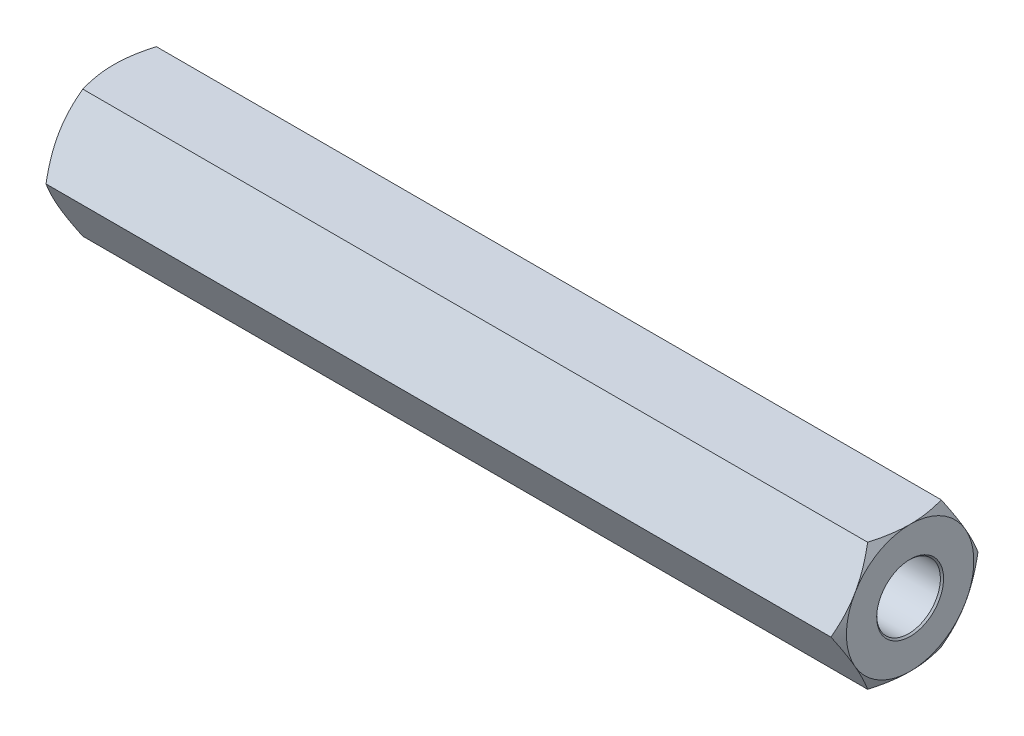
ISO-10303-21;
HEADER;
FILE_DESCRIPTION(('STEP AP214'),'2;1');
FILE_NAME('part.step','',(''),(''),'','','');
FILE_SCHEMA(('AUTOMOTIVE_DESIGN { 1 0 10303 214 1 1 1 1 }'));
ENDSEC;
DATA;
#1=APPLICATION_CONTEXT('core data for automotive mechanical design processes');
#2=APPLICATION_PROTOCOL_DEFINITION('international standard','automotive_design',2000,#1);
#3=PRODUCT_CONTEXT('',#1,'mechanical');
#4=PRODUCT('Part','Part','',(#3));
#5=PRODUCT_RELATED_PRODUCT_CATEGORY('part','',(#4));
#6=PRODUCT_DEFINITION_FORMATION('','',#4);
#7=PRODUCT_DEFINITION_CONTEXT('part definition',#1,'design');
#8=PRODUCT_DEFINITION('design','',#6,#7);
#9=PRODUCT_DEFINITION_SHAPE('','',#8);
#10=(LENGTH_UNIT() NAMED_UNIT(*) SI_UNIT(.MILLI.,.METRE.));
#11=(NAMED_UNIT(*) PLANE_ANGLE_UNIT() SI_UNIT($,.RADIAN.));
#12=(NAMED_UNIT(*) SI_UNIT($,.STERADIAN.) SOLID_ANGLE_UNIT());
#13=UNCERTAINTY_MEASURE_WITH_UNIT(LENGTH_MEASURE(1.E-05),#10,'distance_accuracy_value','');
#14=(GEOMETRIC_REPRESENTATION_CONTEXT(3) GLOBAL_UNCERTAINTY_ASSIGNED_CONTEXT((#13)) GLOBAL_UNIT_ASSIGNED_CONTEXT((#10,
#11,#12)) REPRESENTATION_CONTEXT('',''));
#15=CARTESIAN_POINT('',(0.,0.,0.));
#16=DIRECTION('',(0.,0.,1.));
#17=DIRECTION('',(1.,0.,0.));
#18=AXIS2_PLACEMENT_3D('',#15,#16,#17);
#19=CARTESIAN_POINT('',(50.,0.,-4.61880215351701));
#20=DIRECTION('',(0.,-0.5,0.866025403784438));
#21=DIRECTION('',(0.,-0.866025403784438,-0.5));
#22=AXIS2_PLACEMENT_3D('',#19,#20,#21);
#23=PLANE('',#22);
#24=CARTESIAN_POINT('',(49.6426677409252,-0.000200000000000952,-4.61891762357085));
#25=CARTESIAN_POINT('',(49.7012821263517,0.175579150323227,-4.51743148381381));
#26=CARTESIAN_POINT('',(49.7545896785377,0.35287561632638,-4.41506932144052));
#27=CARTESIAN_POINT('',(49.8476383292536,0.710538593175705,-4.2085725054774));
#28=CARTESIAN_POINT('',(49.8873465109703,0.89091145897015,-4.10443418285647));
#29=CARTESIAN_POINT('',(49.9491577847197,1.24942181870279,-3.89744813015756));
#30=CARTESIAN_POINT('',(49.9716722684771,1.42750415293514,-3.79463224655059));
#31=CARTESIAN_POINT('',(49.9985493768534,1.78450671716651,-3.58851671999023));
#32=CARTESIAN_POINT('',(50.0029342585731,1.9634256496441,-3.48521782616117));
#33=CARTESIAN_POINT('',(49.99380992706,2.29774284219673,-3.29219970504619));
#34=CARTESIAN_POINT('',(49.982541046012,2.45319115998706,-3.20245157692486));
#35=CARTESIAN_POINT('',(49.9468260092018,2.76307505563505,-3.02354002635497));
#36=CARTESIAN_POINT('',(49.9223676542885,2.91750956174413,-2.93437722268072));
#37=CARTESIAN_POINT('',(49.8612239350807,3.22803232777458,-2.75509682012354));
#38=CARTESIAN_POINT('',(49.8242793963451,3.3840812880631,-2.6650019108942));
#39=CARTESIAN_POINT('',(49.740429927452,3.69385183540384,-2.48615580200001));
#40=CARTESIAN_POINT('',(49.6935446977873,3.84757739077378,-2.39740231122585));
#41=CARTESIAN_POINT('',(49.6426677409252,4.0002,-2.30928560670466));
#42=B_SPLINE_CURVE_WITH_KNOTS('',3,(#24,#25,#26,#27,#28,#29,#30,#31,#32,#33,#34,#35,#36,#37,#38,
#39,#40,#41),.UNSPECIFIED.,.F.,.F.,(4,2,2,2,2,2,2,2,4),(0.,0.634047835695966,1.26961969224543,
1.88946157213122,2.50854226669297,3.04757825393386,3.58711366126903,4.13861653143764,
4.68903648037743),.UNSPECIFIED.);
#43=CARTESIAN_POINT('',(49.6427344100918,0.,-4.61880215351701));
#44=VERTEX_POINT('',#43);
#45=CARTESIAN_POINT('',(50.,2.,-3.46410161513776));
#46=VERTEX_POINT('',#45);
#47=EDGE_CURVE('E412',#44,#46,#42,.T.);
#48=ORIENTED_EDGE('',*,*,#47,.F.);
#49=DIRECTION('',(-1.,0.,0.));
#50=VECTOR('',#49,1.);
#51=CARTESIAN_POINT('',(50.,0.,-4.61880215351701));
#52=LINE('',#51,#50);
#53=CARTESIAN_POINT('',(0.357265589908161,0.,-4.61880215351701));
#54=VERTEX_POINT('',#53);
#55=EDGE_CURVE('E276',#44,#54,#52,.T.);
#56=ORIENTED_EDGE('',*,*,#55,.T.);
#57=CARTESIAN_POINT('',(0.357332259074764,4.0002,-2.30928560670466));
#58=CARTESIAN_POINT('',(0.29871787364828,3.82442084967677,-2.4107717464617));
#59=CARTESIAN_POINT('',(0.24541032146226,3.64712438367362,-2.51313390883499));
#60=CARTESIAN_POINT('',(0.152361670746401,3.28946140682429,-2.71963072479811));
#61=CARTESIAN_POINT('',(0.112653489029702,3.10908854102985,-2.82376904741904));
#62=CARTESIAN_POINT('',(0.0508422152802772,2.75057818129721,-3.03075510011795));
#63=CARTESIAN_POINT('',(0.028327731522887,2.57249584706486,-3.13357098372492));
#64=CARTESIAN_POINT('',(0.00145062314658,2.21549328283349,-3.33968651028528));
#65=CARTESIAN_POINT('',(-0.0029342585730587,2.0365743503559,-3.44298540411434));
#66=CARTESIAN_POINT('',(0.00619007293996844,1.70225715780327,-3.63600352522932));
#67=CARTESIAN_POINT('',(0.0174589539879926,1.54680884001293,-3.72575165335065));
#68=CARTESIAN_POINT('',(0.0531739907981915,1.23692494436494,-3.90466320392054));
#69=CARTESIAN_POINT('',(0.0776323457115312,1.08249043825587,-3.99382600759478));
#70=CARTESIAN_POINT('',(0.138776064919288,0.771967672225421,-4.17310641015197));
#71=CARTESIAN_POINT('',(0.175720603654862,0.615918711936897,-4.26320131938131));
#72=CARTESIAN_POINT('',(0.259570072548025,0.30614816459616,-4.4420474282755));
#73=CARTESIAN_POINT('',(0.306455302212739,0.15242260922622,-4.53080091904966));
#74=CARTESIAN_POINT('',(0.357332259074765,-0.000200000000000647,-4.61891762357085));
#75=B_SPLINE_CURVE_WITH_KNOTS('',3,(#57,#58,#59,#60,#61,#62,#63,#64,#65,#66,#67,#68,#69,#70,#71,
#72,#73,#74),.UNSPECIFIED.,.F.,.F.,(4,2,2,2,2,2,2,2,4),(0.,0.634047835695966,1.26961969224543,
1.88946157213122,2.50854226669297,3.04757825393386,3.58711366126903,4.13861653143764,
4.68903648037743),.UNSPECIFIED.);
#76=CARTESIAN_POINT('',(0.,2.,-3.46410161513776));
#77=VERTEX_POINT('',#76);
#78=EDGE_CURVE('E240',#77,#54,#75,.T.);
#79=ORIENTED_EDGE('',*,*,#78,.F.);
#80=CARTESIAN_POINT('',(0.35726558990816,4.,-2.3094010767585));
#81=VERTEX_POINT('',#80);
#82=EDGE_CURVE('E347',#81,#77,#75,.T.);
#83=ORIENTED_EDGE('',*,*,#82,.F.);
#84=DIRECTION('',(-1.,0.,0.));
#85=VECTOR('',#84,1.);
#86=CARTESIAN_POINT('',(50.,4.,-2.3094010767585));
#87=LINE('',#86,#85);
#88=CARTESIAN_POINT('',(49.6427344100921,4.,-2.30940107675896));
#89=VERTEX_POINT('',#88);
#90=EDGE_CURVE('E301',#89,#81,#87,.T.);
#91=ORIENTED_EDGE('',*,*,#90,.F.);
#92=EDGE_CURVE('E138',#46,#89,#42,.T.);
#93=ORIENTED_EDGE('',*,*,#92,.F.);
#94=EDGE_LOOP('',(#48,#56,#79,#83,#91,#93));
#95=FACE_BOUND('',#94,.T.);
#96=ADVANCED_FACE('F43',(#95),#23,.F.);
#97=CARTESIAN_POINT('',(50.,4.,-2.3094010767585));
#98=DIRECTION('',(0.,-1.,0.));
#99=DIRECTION('',(0.,0.,-1.));
#100=AXIS2_PLACEMENT_3D('',#97,#98,#99);
#101=PLANE('',#100);
#102=CARTESIAN_POINT('',(38.9729502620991,4.,-22.7504452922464));
#103=CARTESIAN_POINT('',(39.376397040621,4.,-22.0408787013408));
#104=CARTESIAN_POINT('',(39.7794632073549,4.,-21.3310948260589));
#105=CARTESIAN_POINT('',(40.5849006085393,4.,-19.910065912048));
#106=CARTESIAN_POINT('',(40.9872705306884,4.,-19.1988201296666));
#107=CARTESIAN_POINT('',(41.7996022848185,4.,-17.7592564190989));
#108=CARTESIAN_POINT('',(42.2095284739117,4.,-17.0309183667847));
#109=CARTESIAN_POINT('',(43.0265878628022,4.,-15.5737673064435));
#110=CARTESIAN_POINT('',(43.4337237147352,4.,-14.8449557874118));
#111=CARTESIAN_POINT('',(44.1182763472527,4.,-13.6125764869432));
#112=CARTESIAN_POINT('',(44.3966174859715,4.,-13.1095225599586));
#113=CARTESIAN_POINT('',(44.9509897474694,4.,-12.1021450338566));
#114=CARTESIAN_POINT('',(45.227020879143,4.,-11.5978214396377));
#115=CARTESIAN_POINT('',(45.7769232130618,4.,-10.5853497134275));
#116=CARTESIAN_POINT('',(46.0507811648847,4.,-10.0771943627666));
#117=CARTESIAN_POINT('',(46.4577983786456,4.,-9.31307088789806));
#118=CARTESIAN_POINT('',(46.5928184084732,4.,-9.05809429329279));
#119=CARTESIAN_POINT('',(46.8612975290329,4.,-8.54732120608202));
#120=CARTESIAN_POINT('',(46.9947566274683,4.,-8.29152471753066));
#121=CARTESIAN_POINT('',(47.2573877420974,4.,-7.78338693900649));
#122=CARTESIAN_POINT('',(47.3865939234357,4.,-7.53106333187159));
#123=CARTESIAN_POINT('',(47.6425621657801,4.,-7.0251702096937));
#124=CARTESIAN_POINT('',(47.7693241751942,4.,-6.77160066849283));
#125=CARTESIAN_POINT('',(48.0198372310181,4.,-6.26249566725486));
#126=CARTESIAN_POINT('',(48.1435834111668,4.,-6.00695780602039));
#127=CARTESIAN_POINT('',(48.3867768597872,4.,-5.49385417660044));
#128=CARTESIAN_POINT('',(48.5062243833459,4.,-5.23628852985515));
#129=CARTESIAN_POINT('',(48.7383812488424,4.,-4.72043401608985));
#130=CARTESIAN_POINT('',(48.8511342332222,4.,-4.46216489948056));
#131=CARTESIAN_POINT('',(49.0686068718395,4.,-3.94213500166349));
#132=CARTESIAN_POINT('',(49.1733240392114,4.,-3.68037316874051));
#133=CARTESIAN_POINT('',(49.3710006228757,4.,-3.15320790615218));
#134=CARTESIAN_POINT('',(49.4639909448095,4.,-2.88781618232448));
#135=CARTESIAN_POINT('',(49.6335087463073,4.,-2.35187301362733));
#136=CARTESIAN_POINT('',(49.7100501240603,4.,-2.08132613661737));
#137=CARTESIAN_POINT('',(49.7866672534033,4.,-1.75913029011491));
#138=CARTESIAN_POINT('',(49.7979342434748,4.,-1.71010299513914));
#139=CARTESIAN_POINT('',(49.8196848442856,4.,-1.61186873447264));
#140=CARTESIAN_POINT('',(49.8301683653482,4.,-1.56266174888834));
#141=CARTESIAN_POINT('',(49.8603851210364,4.,-1.41475812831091));
#142=CARTESIAN_POINT('',(49.8788784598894,4.,-1.31580425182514));
#143=CARTESIAN_POINT('',(49.9122206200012,4.,-1.11733177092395));
#144=CARTESIAN_POINT('',(49.9270712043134,4.,-1.01781346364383));
#145=CARTESIAN_POINT('',(49.9528420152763,4.,-0.818270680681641));
#146=CARTESIAN_POINT('',(49.9637624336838,4.,-0.718246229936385));
#147=CARTESIAN_POINT('',(49.9812384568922,4.,-0.520002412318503));
#148=CARTESIAN_POINT('',(49.9878837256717,4.,-0.421791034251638));
#149=CARTESIAN_POINT('',(49.9970368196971,4.,-0.225183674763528));
#150=CARTESIAN_POINT('',(49.9995447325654,4.,-0.126787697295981));
#151=CARTESIAN_POINT('',(50.0007365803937,4.,0.168539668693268));
#152=CARTESIAN_POINT('',(49.993082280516,4.,0.365539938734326));
#153=CARTESIAN_POINT('',(49.9662930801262,4.,0.699382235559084));
#154=CARTESIAN_POINT('',(49.9512796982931,4.,0.836583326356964));
#155=CARTESIAN_POINT('',(49.9139559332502,4.,1.10999932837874));
#156=CARTESIAN_POINT('',(49.8916446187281,4.,1.24621411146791));
#157=CARTESIAN_POINT('',(49.8149470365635,4.,1.65308100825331));
#158=CARTESIAN_POINT('',(49.7508009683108,4.,1.92191347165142));
#159=CARTESIAN_POINT('',(49.6392105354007,4.,2.32468462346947));
#160=CARTESIAN_POINT('',(49.5987986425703,4.,2.46068881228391));
#161=CARTESIAN_POINT('',(49.5137192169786,4.,2.73137245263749));
#162=CARTESIAN_POINT('',(49.4690516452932,4.,2.86605189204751));
#163=CARTESIAN_POINT('',(49.3761762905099,4.,3.13415458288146));
#164=CARTESIAN_POINT('',(49.3279689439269,4.,3.26757798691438));
#165=CARTESIAN_POINT('',(49.2285983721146,4.,3.53330972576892));
#166=CARTESIAN_POINT('',(49.1774352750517,4.,3.66561810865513));
#167=CARTESIAN_POINT('',(49.0629749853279,4.,3.95356589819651));
#168=CARTESIAN_POINT('',(48.9991803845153,4.,4.10900709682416));
#169=CARTESIAN_POINT('',(48.8687729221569,4.,4.41870540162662));
#170=CARTESIAN_POINT('',(48.8021599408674,4.,4.57296245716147));
#171=CARTESIAN_POINT('',(48.5988667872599,4.,5.03427046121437));
#172=CARTESIAN_POINT('',(48.4587530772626,4.,5.33980728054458));
#173=CARTESIAN_POINT('',(48.1721946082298,4.,5.9481268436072));
#174=CARTESIAN_POINT('',(48.0257455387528,4.,6.25090753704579));
#175=CARTESIAN_POINT('',(47.7284239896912,4.,6.85424926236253));
#176=CARTESIAN_POINT('',(47.5775519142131,4.,7.15481049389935));
#177=CARTESIAN_POINT('',(47.2722272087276,4.,7.7549659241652));
#178=CARTESIAN_POINT('',(47.1177672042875,4.,8.0545563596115));
#179=CARTESIAN_POINT('',(46.8064119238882,4.,8.65247464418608));
#180=CARTESIAN_POINT('',(46.6495165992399,4.,8.950802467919));
#181=CARTESIAN_POINT('',(46.3339270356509,4.,9.54635146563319));
#182=CARTESIAN_POINT('',(46.1752335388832,4.,9.84357303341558));
#183=CARTESIAN_POINT('',(45.8563905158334,4.,10.4372345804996));
#184=CARTESIAN_POINT('',(45.6962409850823,4.,10.7336745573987));
#185=CARTESIAN_POINT('',(45.2626637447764,4.,11.5325211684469));
#186=CARTESIAN_POINT('',(44.9881538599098,4.,12.0343402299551));
#187=CARTESIAN_POINT('',(44.4367884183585,4.,13.0367613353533));
#188=CARTESIAN_POINT('',(44.1599325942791,4.,13.5373632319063));
#189=CARTESIAN_POINT('',(43.6056921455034,4.,14.5355555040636));
#190=CARTESIAN_POINT('',(43.3283144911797,4.,15.0331497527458));
#191=CARTESIAN_POINT('',(42.7723179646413,4.,16.0275621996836));
#192=CARTESIAN_POINT('',(42.4936992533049,4.,16.5243804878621));
#193=CARTESIAN_POINT('',(42.2146383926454,4.,17.0209488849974));
#194=B_SPLINE_CURVE_WITH_KNOTS('',3,(#102,#103,#104,#105,#106,#107,#108,#109,#110,#111,#112,
#113,#114,#115,#116,#117,#118,#119,#120,#121,#122,#123,#124,#125,#126,#127,#128,#129,#130,#131,
#132,#133,#134,#135,#136,#137,#138,#139,#140,#141,#142,#143,#144,#145,#146,#147,#148,#149,#150,
#151,#152,#153,#154,#155,#156,#157,#158,#159,#160,#161,#162,#163,#164,#165,#166,#167,#168,#169,
#170,#171,#172,#173,#174,#175,#176,#177,#178,#179,#180,#181,#182,#183,#184,#185,#186,#187,#188,
#189,#190,#191,#192,#193),.UNSPECIFIED.,.F.,.F.,(4,2,2,2,2,2,2,2,2,2,2,2,2,2,2,2,2,2,2,2,2,2,2,
2,2,2,2,2,2,2,2,2,2,2,2,2,2,2,2,2,2,2,2,2,2,4),(0.,2.44873265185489,4.90025117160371,
7.40756626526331,9.91202184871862,11.6367879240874,13.361547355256,15.0932822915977,
15.9588365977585,16.8243866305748,17.6748193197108,18.5252699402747,19.3770124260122,
20.2287042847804,21.0740385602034,21.9196333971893,22.7629509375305,23.6055531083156,
23.7564642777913,23.9073926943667,24.2093279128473,24.5111167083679,24.8128907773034,
25.1081093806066,25.4033217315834,25.9939582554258,26.4078283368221,26.8217512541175,
27.6497236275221,28.0753294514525,28.5009391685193,28.9264964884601,29.3520353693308,
29.8560690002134,30.3601240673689,31.368399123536,32.377371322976,33.3862516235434,
34.397430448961,35.4086295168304,36.4194254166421,37.4302244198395,39.1461989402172,
40.8623717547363,42.5714177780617,44.2802483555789),.UNSPECIFIED.);
#195=CARTESIAN_POINT('',(50.,4.,0.));
#196=VERTEX_POINT('',#195);
#197=EDGE_CURVE('E134',#89,#196,#194,.T.);
#198=ORIENTED_EDGE('',*,*,#197,.F.);
#199=ORIENTED_EDGE('',*,*,#90,.T.);
#200=CARTESIAN_POINT('',(11.0270497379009,4.,-22.7504452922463));
#201=CARTESIAN_POINT('',(10.623602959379,4.,-22.0408787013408));
#202=CARTESIAN_POINT('',(10.220536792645,4.,-21.3310948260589));
#203=CARTESIAN_POINT('',(9.4150993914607,4.,-19.910065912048));
#204=CARTESIAN_POINT('',(9.0127294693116,4.,-19.1988201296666));
#205=CARTESIAN_POINT('',(8.20039771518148,4.,-17.7592564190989));
#206=CARTESIAN_POINT('',(7.79047152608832,4.,-17.0309183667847));
#207=CARTESIAN_POINT('',(6.97341213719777,4.,-15.5737673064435));
#208=CARTESIAN_POINT('',(6.56627628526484,4.,-14.8449557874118));
#209=CARTESIAN_POINT('',(5.88172365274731,4.,-13.6125764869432));
#210=CARTESIAN_POINT('',(5.60338251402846,4.,-13.1095225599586));
#211=CARTESIAN_POINT('',(5.04901025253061,4.,-12.1021450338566));
#212=CARTESIAN_POINT('',(4.77297912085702,4.,-11.5978214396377));
#213=CARTESIAN_POINT('',(4.22307678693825,4.,-10.5853497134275));
#214=CARTESIAN_POINT('',(3.94921883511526,4.,-10.0771943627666));
#215=CARTESIAN_POINT('',(3.5422016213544,4.,-9.31307088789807));
#216=CARTESIAN_POINT('',(3.40718159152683,4.,-9.0580942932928));
#217=CARTESIAN_POINT('',(3.13870247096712,4.,-8.54732120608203));
#218=CARTESIAN_POINT('',(3.00524337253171,4.,-8.29152471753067));
#219=CARTESIAN_POINT('',(2.74261225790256,4.,-7.7833869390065));
#220=CARTESIAN_POINT('',(2.61340607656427,4.,-7.5310633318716));
#221=CARTESIAN_POINT('',(2.35743783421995,4.,-7.02517020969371));
#222=CARTESIAN_POINT('',(2.23067582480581,4.,-6.77160066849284));
#223=CARTESIAN_POINT('',(1.98016276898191,4.,-6.26249566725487));
#224=CARTESIAN_POINT('',(1.85641658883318,4.,-6.0069578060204));
#225=CARTESIAN_POINT('',(1.61322314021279,4.,-5.49385417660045));
#226=CARTESIAN_POINT('',(1.49377561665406,4.,-5.23628852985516));
#227=CARTESIAN_POINT('',(1.26161875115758,4.,-4.72043401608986));
#228=CARTESIAN_POINT('',(1.14886576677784,4.,-4.46216489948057));
#229=CARTESIAN_POINT('',(0.931393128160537,4.,-3.94213500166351));
#230=CARTESIAN_POINT('',(0.826675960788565,4.,-3.68037316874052));
#231=CARTESIAN_POINT('',(0.6289993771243,4.,-3.15320790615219));
#232=CARTESIAN_POINT('',(0.536009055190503,4.,-2.88781618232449));
#233=CARTESIAN_POINT('',(0.366491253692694,4.,-2.35187301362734));
#234=CARTESIAN_POINT('',(0.28994987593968,4.,-2.08132613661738));
#235=CARTESIAN_POINT('',(0.213332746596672,4.,-1.75913029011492));
#236=CARTESIAN_POINT('',(0.202065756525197,4.,-1.71010299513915));
#237=CARTESIAN_POINT('',(0.180315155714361,4.,-1.61186873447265));
#238=CARTESIAN_POINT('',(0.169831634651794,4.,-1.56266174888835));
#239=CARTESIAN_POINT('',(0.139614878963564,4.,-1.41475812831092));
#240=CARTESIAN_POINT('',(0.121121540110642,4.,-1.31580425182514));
#241=CARTESIAN_POINT('',(0.0877793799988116,4.,-1.11733177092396));
#242=CARTESIAN_POINT('',(0.0729287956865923,4.,-1.01781346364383));
#243=CARTESIAN_POINT('',(0.0471579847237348,4.,-0.818270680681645));
#244=CARTESIAN_POINT('',(0.0362375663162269,4.,-0.71824622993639));
#245=CARTESIAN_POINT('',(0.0187615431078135,4.,-0.520002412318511));
#246=CARTESIAN_POINT('',(0.0121162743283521,4.,-0.421791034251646));
#247=CARTESIAN_POINT('',(0.0029631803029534,4.,-0.225183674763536));
#248=CARTESIAN_POINT('',(0.000455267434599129,4.,-0.126787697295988));
#249=CARTESIAN_POINT('',(-0.000736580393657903,4.,0.168539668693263));
#250=CARTESIAN_POINT('',(0.00691771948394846,4.,0.365539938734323));
#251=CARTESIAN_POINT('',(0.0337069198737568,4.,0.699382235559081));
#252=CARTESIAN_POINT('',(0.0487203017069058,4.,0.836583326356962));
#253=CARTESIAN_POINT('',(0.0860440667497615,4.,1.10999932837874));
#254=CARTESIAN_POINT('',(0.108355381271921,4.,1.24621411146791));
#255=CARTESIAN_POINT('',(0.185052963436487,4.,1.6530810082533));
#256=CARTESIAN_POINT('',(0.249199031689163,4.,1.92191347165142));
#257=CARTESIAN_POINT('',(0.360789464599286,4.,2.32468462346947));
#258=CARTESIAN_POINT('',(0.401201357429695,4.,2.46068881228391));
#259=CARTESIAN_POINT('',(0.486280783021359,4.,2.73137245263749));
#260=CARTESIAN_POINT('',(0.530948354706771,4.,2.86605189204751));
#261=CARTESIAN_POINT('',(0.623823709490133,4.,3.13415458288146));
#262=CARTESIAN_POINT('',(0.672031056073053,4.,3.26757798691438));
#263=CARTESIAN_POINT('',(0.771401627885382,4.,3.53330972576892));
#264=CARTESIAN_POINT('',(0.822564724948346,4.,3.66561810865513));
#265=CARTESIAN_POINT('',(0.937025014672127,4.,3.95356589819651));
#266=CARTESIAN_POINT('',(1.00081961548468,4.,4.10900709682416));
#267=CARTESIAN_POINT('',(1.13122707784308,4.,4.41870540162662));
#268=CARTESIAN_POINT('',(1.19784005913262,4.,4.57296245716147));
#269=CARTESIAN_POINT('',(1.40113321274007,4.,5.03427046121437));
#270=CARTESIAN_POINT('',(1.54124692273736,4.,5.33980728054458));
#271=CARTESIAN_POINT('',(1.8278053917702,4.,5.9481268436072));
#272=CARTESIAN_POINT('',(1.97425446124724,4.,6.25090753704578));
#273=CARTESIAN_POINT('',(2.27157601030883,4.,6.85424926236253));
#274=CARTESIAN_POINT('',(2.42244808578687,4.,7.15481049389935));
#275=CARTESIAN_POINT('',(2.72777279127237,4.,7.7549659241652));
#276=CARTESIAN_POINT('',(2.88223279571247,4.,8.0545563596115));
#277=CARTESIAN_POINT('',(3.19358807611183,4.,8.65247464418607));
#278=CARTESIAN_POINT('',(3.35048340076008,4.,8.950802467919));
#279=CARTESIAN_POINT('',(3.66607296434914,4.,9.54635146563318));
#280=CARTESIAN_POINT('',(3.82476646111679,4.,9.84357303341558));
#281=CARTESIAN_POINT('',(4.14360948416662,4.,10.4372345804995));
#282=CARTESIAN_POINT('',(4.30375901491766,4.,10.7336745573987));
#283=CARTESIAN_POINT('',(4.73733625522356,4.,11.5325211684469));
#284=CARTESIAN_POINT('',(5.01184614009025,4.,12.0343402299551));
#285=CARTESIAN_POINT('',(5.56321158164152,4.,13.0367613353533));
#286=CARTESIAN_POINT('',(5.84006740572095,4.,13.5373632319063));
#287=CARTESIAN_POINT('',(6.39430785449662,4.,14.5355555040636));
#288=CARTESIAN_POINT('',(6.67168550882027,4.,15.0331497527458));
#289=CARTESIAN_POINT('',(7.22768203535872,4.,16.0275621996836));
#290=CARTESIAN_POINT('',(7.50630074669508,4.,16.5243804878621));
#291=CARTESIAN_POINT('',(7.78536160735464,4.,17.0209488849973));
#292=B_SPLINE_CURVE_WITH_KNOTS('',3,(#200,#201,#202,#203,#204,#205,#206,#207,#208,#209,#210,
#211,#212,#213,#214,#215,#216,#217,#218,#219,#220,#221,#222,#223,#224,#225,#226,#227,#228,#229,
#230,#231,#232,#233,#234,#235,#236,#237,#238,#239,#240,#241,#242,#243,#244,#245,#246,#247,#248,
#249,#250,#251,#252,#253,#254,#255,#256,#257,#258,#259,#260,#261,#262,#263,#264,#265,#266,#267,
#268,#269,#270,#271,#272,#273,#274,#275,#276,#277,#278,#279,#280,#281,#282,#283,#284,#285,#286,
#287,#288,#289,#290,#291),.UNSPECIFIED.,.F.,.F.,(4,2,2,2,2,2,2,2,2,2,2,2,2,2,2,2,2,2,2,2,2,2,2,
2,2,2,2,2,2,2,2,2,2,2,2,2,2,2,2,2,2,2,2,2,2,4),(0.,2.44873265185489,4.9002511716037,
7.40756626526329,9.9120218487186,11.6367879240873,13.3615473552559,15.0932822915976,
15.9588365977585,16.8243866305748,17.6748193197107,18.5252699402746,19.3770124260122,
20.2287042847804,21.0740385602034,21.9196333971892,22.7629509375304,23.6055531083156,
23.7564642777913,23.9073926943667,24.2093279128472,24.5111167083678,24.8128907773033,
25.1081093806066,25.4033217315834,25.9939582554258,26.407828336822,26.8217512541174,
27.6497236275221,28.0753294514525,28.5009391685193,28.9264964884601,29.3520353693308,
29.8560690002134,30.3601240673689,31.3683991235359,32.377371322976,33.3862516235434,
34.397430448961,35.4086295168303,36.4194254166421,37.4302244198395,39.1461989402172,
40.8623717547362,42.5714177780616,44.2802483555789),.UNSPECIFIED.);
#293=CARTESIAN_POINT('',(0.,4.,0.));
#294=VERTEX_POINT('',#293);
#295=EDGE_CURVE('E237',#294,#81,#292,.F.);
#296=ORIENTED_EDGE('',*,*,#295,.F.);
#297=CARTESIAN_POINT('',(0.357265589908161,4.,2.3094010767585));
#298=VERTEX_POINT('',#297);
#299=EDGE_CURVE('E253',#298,#294,#292,.F.);
#300=ORIENTED_EDGE('',*,*,#299,.F.);
#301=DIRECTION('',(-1.,0.,0.));
#302=VECTOR('',#301,1.);
#303=CARTESIAN_POINT('',(50.,4.,2.3094010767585));
#304=LINE('',#303,#302);
#305=CARTESIAN_POINT('',(49.6427344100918,4.,2.3094010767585));
#306=VERTEX_POINT('',#305);
#307=EDGE_CURVE('E159',#306,#298,#304,.T.);
#308=ORIENTED_EDGE('',*,*,#307,.F.);
#309=EDGE_CURVE('E143',#196,#306,#194,.T.);
#310=ORIENTED_EDGE('',*,*,#309,.F.);
#311=EDGE_LOOP('',(#198,#199,#296,#300,#308,#310));
#312=FACE_BOUND('',#311,.T.);
#313=ADVANCED_FACE('F157',(#312),#101,.F.);
#314=CARTESIAN_POINT('',(50.,4.,2.3094010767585));
#315=DIRECTION('',(0.,-0.5,-0.866025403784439));
#316=DIRECTION('',(0.,0.866025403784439,-0.5));
#317=AXIS2_PLACEMENT_3D('',#314,#315,#316);
#318=PLANE('',#317);
#319=CARTESIAN_POINT('',(49.6426677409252,4.0002,2.30928560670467));
#320=CARTESIAN_POINT('',(49.7012821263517,3.82442084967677,2.41077174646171));
#321=CARTESIAN_POINT('',(49.7545896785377,3.64712438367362,2.513133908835));
#322=CARTESIAN_POINT('',(49.8476383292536,3.28946140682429,2.71963072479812));
#323=CARTESIAN_POINT('',(49.8873465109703,3.10908854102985,2.82376904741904));
#324=CARTESIAN_POINT('',(49.9491577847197,2.75057818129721,3.03075510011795));
#325=CARTESIAN_POINT('',(49.9716722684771,2.57249584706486,3.13357098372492));
#326=CARTESIAN_POINT('',(49.9985493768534,2.21549328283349,3.33968651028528));
#327=CARTESIAN_POINT('',(50.0029342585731,2.0365743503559,3.44298540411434));
#328=CARTESIAN_POINT('',(49.99380992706,1.70225715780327,3.63600352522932));
#329=CARTESIAN_POINT('',(49.982541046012,1.54680884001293,3.72575165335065));
#330=CARTESIAN_POINT('',(49.9468260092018,1.23692494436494,3.90466320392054));
#331=CARTESIAN_POINT('',(49.9223676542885,1.08249043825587,3.99382600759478));
#332=CARTESIAN_POINT('',(49.8612239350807,0.77196767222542,4.17310641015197));
#333=CARTESIAN_POINT('',(49.8242793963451,0.615918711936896,4.26320131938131));
#334=CARTESIAN_POINT('',(49.740429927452,0.306148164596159,4.4420474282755));
#335=CARTESIAN_POINT('',(49.6935446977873,0.152422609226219,4.53080091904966));
#336=CARTESIAN_POINT('',(49.6426677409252,-0.000200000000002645,4.61891762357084));
#337=B_SPLINE_CURVE_WITH_KNOTS('',3,(#319,#320,#321,#322,#323,#324,#325,#326,#327,#328,#329,
#330,#331,#332,#333,#334,#335,#336),.UNSPECIFIED.,.F.,.F.,(4,2,2,2,2,2,2,2,4),(0.,
0.634047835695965,1.26961969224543,1.88946157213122,2.50854226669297,3.04757825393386,
3.58711366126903,4.13861653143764,4.68903648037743),.UNSPECIFIED.);
#338=CARTESIAN_POINT('',(50.,2.,3.46410161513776));
#339=VERTEX_POINT('',#338);
#340=EDGE_CURVE('E148',#306,#339,#337,.T.);
#341=ORIENTED_EDGE('',*,*,#340,.F.);
#342=ORIENTED_EDGE('',*,*,#307,.T.);
#343=CARTESIAN_POINT('',(0.357332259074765,-0.000200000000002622,4.61891762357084));
#344=CARTESIAN_POINT('',(0.298717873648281,0.175579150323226,4.51743148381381));
#345=CARTESIAN_POINT('',(0.245410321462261,0.352875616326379,4.41506932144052));
#346=CARTESIAN_POINT('',(0.152361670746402,0.710538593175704,4.2085725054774));
#347=CARTESIAN_POINT('',(0.112653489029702,0.890911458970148,4.10443418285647));
#348=CARTESIAN_POINT('',(0.0508422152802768,1.24942181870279,3.89744813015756));
#349=CARTESIAN_POINT('',(0.0283277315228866,1.42750415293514,3.79463224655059));
#350=CARTESIAN_POINT('',(0.00145062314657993,1.78450671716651,3.58851671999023));
#351=CARTESIAN_POINT('',(-0.00293425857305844,1.9634256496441,3.48521782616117));
#352=CARTESIAN_POINT('',(0.00619007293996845,2.29774284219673,3.29219970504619));
#353=CARTESIAN_POINT('',(0.0174589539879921,2.45319115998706,3.20245157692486));
#354=CARTESIAN_POINT('',(0.0531739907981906,2.76307505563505,3.02354002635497));
#355=CARTESIAN_POINT('',(0.0776323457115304,2.91750956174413,2.93437722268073));
#356=CARTESIAN_POINT('',(0.138776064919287,3.22803232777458,2.75509682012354));
#357=CARTESIAN_POINT('',(0.175720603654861,3.3840812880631,2.6650019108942));
#358=CARTESIAN_POINT('',(0.259570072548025,3.69385183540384,2.48615580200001));
#359=CARTESIAN_POINT('',(0.306455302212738,3.84757739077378,2.39740231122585));
#360=CARTESIAN_POINT('',(0.357332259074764,4.0002,2.30928560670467));
#361=B_SPLINE_CURVE_WITH_KNOTS('',3,(#343,#344,#345,#346,#347,#348,#349,#350,#351,#352,#353,
#354,#355,#356,#357,#358,#359,#360),.UNSPECIFIED.,.F.,.F.,(4,2,2,2,2,2,2,2,4),(0.,
0.634047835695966,1.26961969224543,1.88946157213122,2.50854226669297,3.04757825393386,
3.58711366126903,4.13861653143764,4.68903648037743),.UNSPECIFIED.);
#362=CARTESIAN_POINT('',(0.,2.,3.46410161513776));
#363=VERTEX_POINT('',#362);
#364=EDGE_CURVE('E254',#363,#298,#361,.T.);
#365=ORIENTED_EDGE('',*,*,#364,.F.);
#366=CARTESIAN_POINT('',(0.357265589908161,0.,4.61880215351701));
#367=VERTEX_POINT('',#366);
#368=EDGE_CURVE('E262',#367,#363,#361,.T.);
#369=ORIENTED_EDGE('',*,*,#368,.F.);
#370=DIRECTION('',(-1.,0.,0.));
#371=VECTOR('',#370,1.);
#372=CARTESIAN_POINT('',(50.,0.,4.61880215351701));
#373=LINE('',#372,#371);
#374=CARTESIAN_POINT('',(49.6427344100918,0.,4.61880215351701));
#375=VERTEX_POINT('',#374);
#376=EDGE_CURVE('E296',#375,#367,#373,.T.);
#377=ORIENTED_EDGE('',*,*,#376,.F.);
#378=EDGE_CURVE('E162',#339,#375,#337,.T.);
#379=ORIENTED_EDGE('',*,*,#378,.F.);
#380=EDGE_LOOP('',(#341,#342,#365,#369,#377,#379));
#381=FACE_BOUND('',#380,.T.);
#382=ADVANCED_FACE('F223',(#381),#318,.F.);
#383=CARTESIAN_POINT('',(50.,0.,4.61880215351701));
#384=DIRECTION('',(0.,0.5,-0.866025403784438));
#385=DIRECTION('',(0.,0.866025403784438,0.5));
#386=AXIS2_PLACEMENT_3D('',#383,#384,#385);
#387=PLANE('',#386);
#388=CARTESIAN_POINT('',(49.6426677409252,0.000199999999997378,4.61891762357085));
#389=CARTESIAN_POINT('',(49.7012821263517,-0.17557915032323,4.51743148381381));
#390=CARTESIAN_POINT('',(49.7545896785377,-0.352875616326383,4.41506932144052));
#391=CARTESIAN_POINT('',(49.8476383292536,-0.710538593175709,4.20857250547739));
#392=CARTESIAN_POINT('',(49.8873465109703,-0.890911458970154,4.10443418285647));
#393=CARTESIAN_POINT('',(49.9491577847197,-1.24942181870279,3.89744813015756));
#394=CARTESIAN_POINT('',(49.9716722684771,-1.42750415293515,3.79463224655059));
#395=CARTESIAN_POINT('',(49.9985493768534,-1.78450671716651,3.58851671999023));
#396=CARTESIAN_POINT('',(50.0029342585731,-1.9634256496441,3.48521782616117));
#397=CARTESIAN_POINT('',(49.99380992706,-2.29774284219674,3.29219970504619));
#398=CARTESIAN_POINT('',(49.982541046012,-2.45319115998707,3.20245157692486));
#399=CARTESIAN_POINT('',(49.9468260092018,-2.76307505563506,3.02354002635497));
#400=CARTESIAN_POINT('',(49.9223676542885,-2.91750956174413,2.93437722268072));
#401=CARTESIAN_POINT('',(49.8612239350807,-3.22803232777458,2.75509682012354));
#402=CARTESIAN_POINT('',(49.8242793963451,-3.38408128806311,2.6650019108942));
#403=CARTESIAN_POINT('',(49.740429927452,-3.69385183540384,2.48615580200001));
#404=CARTESIAN_POINT('',(49.6935446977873,-3.84757739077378,2.39740231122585));
#405=CARTESIAN_POINT('',(49.6426677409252,-4.0002,2.30928560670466));
#406=B_SPLINE_CURVE_WITH_KNOTS('',3,(#388,#389,#390,#391,#392,#393,#394,#395,#396,#397,#398,
#399,#400,#401,#402,#403,#404,#405),.UNSPECIFIED.,.F.,.F.,(4,2,2,2,2,2,2,2,4),(0.,
0.634047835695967,1.26961969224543,1.88946157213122,2.50854226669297,3.04757825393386,
3.58711366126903,4.13861653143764,4.68903648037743),.UNSPECIFIED.);
#407=CARTESIAN_POINT('',(50.,-2.,3.46410161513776));
#408=VERTEX_POINT('',#407);
#409=EDGE_CURVE('E217',#375,#408,#406,.T.);
#410=ORIENTED_EDGE('',*,*,#409,.F.);
#411=ORIENTED_EDGE('',*,*,#376,.T.);
#412=CARTESIAN_POINT('',(0.357332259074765,-4.0002,2.30928560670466));
#413=CARTESIAN_POINT('',(0.298717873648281,-3.82442084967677,2.4107717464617));
#414=CARTESIAN_POINT('',(0.245410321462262,-3.64712438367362,2.51313390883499));
#415=CARTESIAN_POINT('',(0.152361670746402,-3.2894614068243,2.71963072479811));
#416=CARTESIAN_POINT('',(0.112653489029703,-3.10908854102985,2.82376904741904));
#417=CARTESIAN_POINT('',(0.0508422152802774,-2.75057818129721,3.03075510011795));
#418=CARTESIAN_POINT('',(0.0283277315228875,-2.57249584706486,3.13357098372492));
#419=CARTESIAN_POINT('',(0.0014506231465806,-2.21549328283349,3.33968651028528));
#420=CARTESIAN_POINT('',(-0.0029342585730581,-2.0365743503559,3.44298540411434));
#421=CARTESIAN_POINT('',(0.00619007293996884,-1.70225715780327,3.63600352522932));
#422=CARTESIAN_POINT('',(0.0174589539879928,-1.54680884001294,3.72575165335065));
#423=CARTESIAN_POINT('',(0.0531739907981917,-1.23692494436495,3.90466320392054));
#424=CARTESIAN_POINT('',(0.0776323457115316,-1.08249043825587,3.99382600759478));
#425=CARTESIAN_POINT('',(0.138776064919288,-0.771967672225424,4.17310641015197));
#426=CARTESIAN_POINT('',(0.175720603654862,-0.6159187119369,4.26320131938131));
#427=CARTESIAN_POINT('',(0.259570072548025,-0.306148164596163,4.4420474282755));
#428=CARTESIAN_POINT('',(0.306455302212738,-0.152422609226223,4.53080091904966));
#429=CARTESIAN_POINT('',(0.357332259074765,0.000199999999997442,4.61891762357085));
#430=B_SPLINE_CURVE_WITH_KNOTS('',3,(#412,#413,#414,#415,#416,#417,#418,#419,#420,#421,#422,
#423,#424,#425,#426,#427,#428,#429),.UNSPECIFIED.,.F.,.F.,(4,2,2,2,2,2,2,2,4),(0.,
0.634047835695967,1.26961969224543,1.88946157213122,2.50854226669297,3.04757825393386,
3.58711366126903,4.13861653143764,4.68903648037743),.UNSPECIFIED.);
#431=CARTESIAN_POINT('',(0.,-2.,3.46410161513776));
#432=VERTEX_POINT('',#431);
#433=EDGE_CURVE('E239',#432,#367,#430,.T.);
#434=ORIENTED_EDGE('',*,*,#433,.F.);
#435=CARTESIAN_POINT('',(0.357265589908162,-4.,2.3094010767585));
#436=VERTEX_POINT('',#435);
#437=EDGE_CURVE('E229',#436,#432,#430,.T.);
#438=ORIENTED_EDGE('',*,*,#437,.F.);
#439=DIRECTION('',(-1.,0.,0.));
#440=VECTOR('',#439,1.);
#441=CARTESIAN_POINT('',(50.,-4.,2.3094010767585));
#442=LINE('',#441,#440);
#443=CARTESIAN_POINT('',(49.6427344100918,-4.,2.3094010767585));
#444=VERTEX_POINT('',#443);
#445=EDGE_CURVE('E293',#444,#436,#442,.T.);
#446=ORIENTED_EDGE('',*,*,#445,.F.);
#447=EDGE_CURVE('E210',#408,#444,#406,.T.);
#448=ORIENTED_EDGE('',*,*,#447,.F.);
#449=EDGE_LOOP('',(#410,#411,#434,#438,#446,#448));
#450=FACE_BOUND('',#449,.T.);
#451=ADVANCED_FACE('F219',(#450),#387,.F.);
#452=CARTESIAN_POINT('',(50.,-4.,2.3094010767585));
#453=DIRECTION('',(0.,1.,0.));
#454=DIRECTION('',(0.,0.,1.));
#455=AXIS2_PLACEMENT_3D('',#452,#453,#454);
#456=PLANE('',#455);
#457=CARTESIAN_POINT('',(38.9729502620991,-3.99999999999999,-22.7504452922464));
#458=CARTESIAN_POINT('',(39.376397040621,-3.99999999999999,-22.0408787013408));
#459=CARTESIAN_POINT('',(39.7794632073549,-3.99999999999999,-21.3310948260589));
#460=CARTESIAN_POINT('',(40.5849006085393,-3.99999999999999,-19.910065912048));
#461=CARTESIAN_POINT('',(40.9872705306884,-3.99999999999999,-19.1988201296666));
#462=CARTESIAN_POINT('',(41.7996022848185,-3.99999999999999,-17.7592564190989));
#463=CARTESIAN_POINT('',(42.2095284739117,-4.,-17.0309183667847));
#464=CARTESIAN_POINT('',(43.0265878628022,-4.,-15.5737673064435));
#465=CARTESIAN_POINT('',(43.4337237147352,-4.,-14.8449557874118));
#466=CARTESIAN_POINT('',(44.1182763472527,-4.,-13.6125764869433));
#467=CARTESIAN_POINT('',(44.3966174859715,-4.,-13.1095225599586));
#468=CARTESIAN_POINT('',(44.9509897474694,-4.,-12.1021450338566));
#469=CARTESIAN_POINT('',(45.227020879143,-4.,-11.5978214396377));
#470=CARTESIAN_POINT('',(45.7769232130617,-4.,-10.5853497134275));
#471=CARTESIAN_POINT('',(46.0507811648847,-4.,-10.0771943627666));
#472=CARTESIAN_POINT('',(46.4577983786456,-4.,-9.31307088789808));
#473=CARTESIAN_POINT('',(46.5928184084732,-4.,-9.05809429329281));
#474=CARTESIAN_POINT('',(46.8612975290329,-4.,-8.54732120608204));
#475=CARTESIAN_POINT('',(46.9947566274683,-4.,-8.29152471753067));
#476=CARTESIAN_POINT('',(47.2573877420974,-4.,-7.78338693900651));
#477=CARTESIAN_POINT('',(47.3865939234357,-4.,-7.53106333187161));
#478=CARTESIAN_POINT('',(47.64256216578,-4.,-7.02517020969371));
#479=CARTESIAN_POINT('',(47.7693241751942,-4.,-6.77160066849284));
#480=CARTESIAN_POINT('',(48.0198372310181,-4.,-6.26249566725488));
#481=CARTESIAN_POINT('',(48.1435834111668,-4.,-6.0069578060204));
#482=CARTESIAN_POINT('',(48.3867768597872,-4.,-5.49385417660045));
#483=CARTESIAN_POINT('',(48.5062243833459,-4.,-5.23628852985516));
#484=CARTESIAN_POINT('',(48.7383812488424,-4.,-4.72043401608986));
#485=CARTESIAN_POINT('',(48.8511342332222,-4.,-4.46216489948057));
#486=CARTESIAN_POINT('',(49.0686068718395,-4.,-3.9421350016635));
#487=CARTESIAN_POINT('',(49.1733240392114,-4.,-3.68037316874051));
#488=CARTESIAN_POINT('',(49.3710006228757,-4.,-3.15320790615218));
#489=CARTESIAN_POINT('',(49.4639909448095,-4.,-2.88781618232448));
#490=CARTESIAN_POINT('',(49.6335087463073,-4.,-2.35187301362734));
#491=CARTESIAN_POINT('',(49.7100501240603,-4.,-2.08132613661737));
#492=CARTESIAN_POINT('',(49.7866672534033,-4.,-1.75913029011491));
#493=CARTESIAN_POINT('',(49.7979342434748,-4.,-1.71010299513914));
#494=CARTESIAN_POINT('',(49.8196848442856,-4.,-1.61186873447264));
#495=CARTESIAN_POINT('',(49.8301683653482,-4.,-1.56266174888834));
#496=CARTESIAN_POINT('',(49.8603851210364,-4.,-1.41475812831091));
#497=CARTESIAN_POINT('',(49.8788784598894,-4.,-1.31580425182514));
#498=CARTESIAN_POINT('',(49.9122206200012,-4.,-1.11733177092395));
#499=CARTESIAN_POINT('',(49.9270712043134,-4.,-1.01781346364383));
#500=CARTESIAN_POINT('',(49.9528420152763,-4.,-0.818270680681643));
#501=CARTESIAN_POINT('',(49.9637624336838,-4.,-0.718246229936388));
#502=CARTESIAN_POINT('',(49.9812384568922,-4.,-0.52000241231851));
#503=CARTESIAN_POINT('',(49.9878837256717,-4.,-0.421791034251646));
#504=CARTESIAN_POINT('',(49.9970368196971,-4.,-0.225183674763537));
#505=CARTESIAN_POINT('',(49.9995447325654,-4.,-0.12678769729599));
#506=CARTESIAN_POINT('',(50.0007365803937,-4.,0.168539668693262));
#507=CARTESIAN_POINT('',(49.993082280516,-4.,0.365539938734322));
#508=CARTESIAN_POINT('',(49.9662930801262,-4.,0.69938223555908));
#509=CARTESIAN_POINT('',(49.9512796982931,-4.,0.836583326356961));
#510=CARTESIAN_POINT('',(49.9139559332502,-4.,1.10999932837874));
#511=CARTESIAN_POINT('',(49.8916446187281,-4.,1.24621411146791));
#512=CARTESIAN_POINT('',(49.8149470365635,-4.,1.6530810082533));
#513=CARTESIAN_POINT('',(49.7508009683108,-4.,1.92191347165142));
#514=CARTESIAN_POINT('',(49.6392105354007,-4.,2.32468462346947));
#515=CARTESIAN_POINT('',(49.5987986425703,-4.,2.46068881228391));
#516=CARTESIAN_POINT('',(49.5137192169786,-4.,2.73137245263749));
#517=CARTESIAN_POINT('',(49.4690516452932,-4.,2.86605189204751));
#518=CARTESIAN_POINT('',(49.3761762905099,-4.,3.13415458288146));
#519=CARTESIAN_POINT('',(49.3279689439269,-4.,3.26757798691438));
#520=CARTESIAN_POINT('',(49.2285983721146,-4.,3.53330972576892));
#521=CARTESIAN_POINT('',(49.1774352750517,-4.,3.66561810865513));
#522=CARTESIAN_POINT('',(49.0629749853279,-4.,3.9535658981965));
#523=CARTESIAN_POINT('',(48.9991803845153,-4.,4.10900709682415));
#524=CARTESIAN_POINT('',(48.8687729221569,-4.,4.41870540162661));
#525=CARTESIAN_POINT('',(48.8021599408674,-4.,4.57296245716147));
#526=CARTESIAN_POINT('',(48.5988667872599,-4.,5.03427046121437));
#527=CARTESIAN_POINT('',(48.4587530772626,-4.,5.33980728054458));
#528=CARTESIAN_POINT('',(48.1721946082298,-4.,5.9481268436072));
#529=CARTESIAN_POINT('',(48.0257455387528,-4.,6.25090753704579));
#530=CARTESIAN_POINT('',(47.7284239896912,-4.,6.85424926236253));
#531=CARTESIAN_POINT('',(47.5775519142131,-4.,7.15481049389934));
#532=CARTESIAN_POINT('',(47.2722272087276,-4.,7.75496592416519));
#533=CARTESIAN_POINT('',(47.1177672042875,-4.00000000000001,8.0545563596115));
#534=CARTESIAN_POINT('',(46.8064119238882,-4.00000000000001,8.65247464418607));
#535=CARTESIAN_POINT('',(46.6495165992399,-4.00000000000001,8.95080246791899));
#536=CARTESIAN_POINT('',(46.3339270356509,-4.00000000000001,9.54635146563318));
#537=CARTESIAN_POINT('',(46.1752335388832,-4.00000000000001,9.84357303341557));
#538=CARTESIAN_POINT('',(45.8563905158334,-4.00000000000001,10.4372345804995));
#539=CARTESIAN_POINT('',(45.6962409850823,-4.00000000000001,10.7336745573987));
#540=CARTESIAN_POINT('',(45.2626637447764,-4.00000000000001,11.5325211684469));
#541=CARTESIAN_POINT('',(44.9881538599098,-4.00000000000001,12.0343402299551));
#542=CARTESIAN_POINT('',(44.4367884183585,-4.00000000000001,13.0367613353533));
#543=CARTESIAN_POINT('',(44.1599325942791,-4.00000000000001,13.5373632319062));
#544=CARTESIAN_POINT('',(43.6056921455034,-4.00000000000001,14.5355555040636));
#545=CARTESIAN_POINT('',(43.3283144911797,-4.00000000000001,15.0331497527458));
#546=CARTESIAN_POINT('',(42.7723179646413,-4.00000000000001,16.0275621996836));
#547=CARTESIAN_POINT('',(42.4936992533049,-4.00000000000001,16.5243804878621));
#548=CARTESIAN_POINT('',(42.2146383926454,-4.00000000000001,17.0209488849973));
#549=B_SPLINE_CURVE_WITH_KNOTS('',3,(#457,#458,#459,#460,#461,#462,#463,#464,#465,#466,#467,
#468,#469,#470,#471,#472,#473,#474,#475,#476,#477,#478,#479,#480,#481,#482,#483,#484,#485,#486,
#487,#488,#489,#490,#491,#492,#493,#494,#495,#496,#497,#498,#499,#500,#501,#502,#503,#504,#505,
#506,#507,#508,#509,#510,#511,#512,#513,#514,#515,#516,#517,#518,#519,#520,#521,#522,#523,#524,
#525,#526,#527,#528,#529,#530,#531,#532,#533,#534,#535,#536,#537,#538,#539,#540,#541,#542,#543,
#544,#545,#546,#547,#548),.UNSPECIFIED.,.F.,.F.,(4,2,2,2,2,2,2,2,2,2,2,2,2,2,2,2,2,2,2,2,2,2,2,
2,2,2,2,2,2,2,2,2,2,2,2,2,2,2,2,2,2,2,2,2,2,4),(0.,2.44873265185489,4.9002511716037,
7.4075662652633,9.91202184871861,11.6367879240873,13.3615473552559,15.0932822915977,
15.9588365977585,16.8243866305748,17.6748193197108,18.5252699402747,19.3770124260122,
20.2287042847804,21.0740385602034,21.9196333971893,22.7629509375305,23.6055531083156,
23.7564642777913,23.9073926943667,24.2093279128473,24.5111167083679,24.8128907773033,
25.1081093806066,25.4033217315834,25.9939582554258,26.4078283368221,26.8217512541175,
27.6497236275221,28.0753294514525,28.5009391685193,28.9264964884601,29.3520353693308,
29.8560690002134,30.3601240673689,31.368399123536,32.377371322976,33.3862516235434,
34.397430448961,35.4086295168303,36.4194254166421,37.4302244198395,39.1461989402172,
40.8623717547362,42.5714177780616,44.2802483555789),.UNSPECIFIED.);
#550=CARTESIAN_POINT('',(50.,-4.,0.));
#551=VERTEX_POINT('',#550);
#552=EDGE_CURVE('E218',#444,#551,#549,.F.);
#553=ORIENTED_EDGE('',*,*,#552,.F.);
#554=ORIENTED_EDGE('',*,*,#445,.T.);
#555=CARTESIAN_POINT('',(11.0270497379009,-3.99999999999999,-22.7504452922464));
#556=CARTESIAN_POINT('',(10.623602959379,-3.99999999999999,-22.0408787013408));
#557=CARTESIAN_POINT('',(10.2205367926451,-3.99999999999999,-21.3310948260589));
#558=CARTESIAN_POINT('',(9.41509939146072,-3.99999999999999,-19.910065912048));
#559=CARTESIAN_POINT('',(9.01272946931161,-3.99999999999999,-19.1988201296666));
#560=CARTESIAN_POINT('',(8.20039771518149,-3.99999999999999,-17.7592564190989));
#561=CARTESIAN_POINT('',(7.79047152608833,-4.,-17.0309183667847));
#562=CARTESIAN_POINT('',(6.97341213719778,-4.,-15.5737673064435));
#563=CARTESIAN_POINT('',(6.56627628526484,-4.,-14.8449557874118));
#564=CARTESIAN_POINT('',(5.88172365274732,-4.,-13.6125764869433));
#565=CARTESIAN_POINT('',(5.60338251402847,-4.,-13.1095225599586));
#566=CARTESIAN_POINT('',(5.04901025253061,-4.,-12.1021450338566));
#567=CARTESIAN_POINT('',(4.77297912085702,-4.,-11.5978214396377));
#568=CARTESIAN_POINT('',(4.22307678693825,-4.,-10.5853497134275));
#569=CARTESIAN_POINT('',(3.94921883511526,-4.,-10.0771943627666));
#570=CARTESIAN_POINT('',(3.5422016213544,-4.,-9.31307088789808));
#571=CARTESIAN_POINT('',(3.40718159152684,-4.,-9.05809429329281));
#572=CARTESIAN_POINT('',(3.13870247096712,-4.,-8.54732120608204));
#573=CARTESIAN_POINT('',(3.00524337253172,-4.,-8.29152471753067));
#574=CARTESIAN_POINT('',(2.74261225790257,-4.,-7.78338693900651));
#575=CARTESIAN_POINT('',(2.61340607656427,-4.,-7.53106333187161));
#576=CARTESIAN_POINT('',(2.35743783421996,-4.,-7.02517020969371));
#577=CARTESIAN_POINT('',(2.23067582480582,-4.,-6.77160066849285));
#578=CARTESIAN_POINT('',(1.98016276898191,-4.,-6.26249566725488));
#579=CARTESIAN_POINT('',(1.85641658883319,-4.,-6.0069578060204));
#580=CARTESIAN_POINT('',(1.61322314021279,-4.,-5.49385417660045));
#581=CARTESIAN_POINT('',(1.49377561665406,-4.,-5.23628852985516));
#582=CARTESIAN_POINT('',(1.26161875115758,-4.,-4.72043401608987));
#583=CARTESIAN_POINT('',(1.14886576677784,-4.,-4.46216489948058));
#584=CARTESIAN_POINT('',(0.931393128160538,-4.,-3.94213500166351));
#585=CARTESIAN_POINT('',(0.826675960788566,-4.,-3.68037316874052));
#586=CARTESIAN_POINT('',(0.628999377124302,-4.,-3.15320790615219));
#587=CARTESIAN_POINT('',(0.536009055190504,-4.,-2.88781618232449));
#588=CARTESIAN_POINT('',(0.366491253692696,-4.,-2.35187301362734));
#589=CARTESIAN_POINT('',(0.289949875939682,-4.,-2.08132613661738));
#590=CARTESIAN_POINT('',(0.213332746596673,-4.,-1.75913029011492));
#591=CARTESIAN_POINT('',(0.202065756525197,-4.,-1.71010299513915));
#592=CARTESIAN_POINT('',(0.180315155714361,-4.,-1.61186873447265));
#593=CARTESIAN_POINT('',(0.169831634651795,-4.,-1.56266174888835));
#594=CARTESIAN_POINT('',(0.139614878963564,-4.,-1.41475812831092));
#595=CARTESIAN_POINT('',(0.121121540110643,-4.,-1.31580425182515));
#596=CARTESIAN_POINT('',(0.0877793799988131,-4.,-1.11733177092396));
#597=CARTESIAN_POINT('',(0.072928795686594,-4.,-1.01781346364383));
#598=CARTESIAN_POINT('',(0.0471579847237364,-4.,-0.818270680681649));
#599=CARTESIAN_POINT('',(0.0362375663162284,-4.,-0.718246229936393));
#600=CARTESIAN_POINT('',(0.0187615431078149,-4.,-0.520002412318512));
#601=CARTESIAN_POINT('',(0.0121162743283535,-4.,-0.421791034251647));
#602=CARTESIAN_POINT('',(0.0029631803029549,-4.,-0.225183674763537));
#603=CARTESIAN_POINT('',(0.000455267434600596,-4.,-0.126787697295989));
#604=CARTESIAN_POINT('',(-0.000736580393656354,-4.,0.168539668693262));
#605=CARTESIAN_POINT('',(0.00691771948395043,-4.,0.365539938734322));
#606=CARTESIAN_POINT('',(0.0337069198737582,-4.,0.69938223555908));
#607=CARTESIAN_POINT('',(0.0487203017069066,-4.,0.83658332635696));
#608=CARTESIAN_POINT('',(0.0860440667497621,-4.,1.10999932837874));
#609=CARTESIAN_POINT('',(0.108355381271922,-4.,1.24621411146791));
#610=CARTESIAN_POINT('',(0.185052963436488,-4.,1.6530810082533));
#611=CARTESIAN_POINT('',(0.249199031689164,-4.,1.92191347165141));
#612=CARTESIAN_POINT('',(0.360789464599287,-4.,2.32468462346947));
#613=CARTESIAN_POINT('',(0.401201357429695,-4.,2.46068881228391));
#614=CARTESIAN_POINT('',(0.48628078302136,-4.,2.73137245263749));
#615=CARTESIAN_POINT('',(0.530948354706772,-4.,2.86605189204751));
#616=CARTESIAN_POINT('',(0.623823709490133,-4.,3.13415458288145));
#617=CARTESIAN_POINT('',(0.672031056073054,-4.,3.26757798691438));
#618=CARTESIAN_POINT('',(0.771401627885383,-4.,3.53330972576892));
#619=CARTESIAN_POINT('',(0.822564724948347,-4.,3.66561810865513));
#620=CARTESIAN_POINT('',(0.937025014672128,-4.,3.9535658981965));
#621=CARTESIAN_POINT('',(1.00081961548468,-4.,4.10900709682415));
#622=CARTESIAN_POINT('',(1.13122707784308,-4.,4.41870540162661));
#623=CARTESIAN_POINT('',(1.19784005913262,-4.,4.57296245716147));
#624=CARTESIAN_POINT('',(1.40113321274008,-4.,5.03427046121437));
#625=CARTESIAN_POINT('',(1.54124692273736,-4.,5.33980728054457));
#626=CARTESIAN_POINT('',(1.8278053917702,-4.,5.9481268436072));
#627=CARTESIAN_POINT('',(1.97425446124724,-4.,6.25090753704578));
#628=CARTESIAN_POINT('',(2.27157601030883,-4.,6.85424926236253));
#629=CARTESIAN_POINT('',(2.42244808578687,-4.,7.15481049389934));
#630=CARTESIAN_POINT('',(2.72777279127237,-4.,7.75496592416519));
#631=CARTESIAN_POINT('',(2.88223279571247,-4.00000000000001,8.05455635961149));
#632=CARTESIAN_POINT('',(3.19358807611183,-4.00000000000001,8.65247464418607));
#633=CARTESIAN_POINT('',(3.35048340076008,-4.00000000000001,8.950802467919));
#634=CARTESIAN_POINT('',(3.66607296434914,-4.00000000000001,9.54635146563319));
#635=CARTESIAN_POINT('',(3.82476646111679,-4.00000000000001,9.84357303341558));
#636=CARTESIAN_POINT('',(4.14360948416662,-4.00000000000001,10.4372345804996));
#637=CARTESIAN_POINT('',(4.30375901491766,-4.00000000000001,10.7336745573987));
#638=CARTESIAN_POINT('',(4.73733625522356,-4.00000000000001,11.5325211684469));
#639=CARTESIAN_POINT('',(5.01184614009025,-4.00000000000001,12.0343402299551));
#640=CARTESIAN_POINT('',(5.56321158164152,-4.00000000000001,13.0367613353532));
#641=CARTESIAN_POINT('',(5.84006740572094,-4.00000000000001,13.5373632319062));
#642=CARTESIAN_POINT('',(6.39430785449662,-4.00000000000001,14.5355555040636));
#643=CARTESIAN_POINT('',(6.67168550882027,-4.00000000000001,15.0331497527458));
#644=CARTESIAN_POINT('',(7.22768203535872,-4.00000000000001,16.0275621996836));
#645=CARTESIAN_POINT('',(7.50630074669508,-4.00000000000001,16.5243804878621));
#646=CARTESIAN_POINT('',(7.78536160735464,-4.00000000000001,17.0209488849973));
#647=B_SPLINE_CURVE_WITH_KNOTS('',3,(#555,#556,#557,#558,#559,#560,#561,#562,#563,#564,#565,
#566,#567,#568,#569,#570,#571,#572,#573,#574,#575,#576,#577,#578,#579,#580,#581,#582,#583,#584,
#585,#586,#587,#588,#589,#590,#591,#592,#593,#594,#595,#596,#597,#598,#599,#600,#601,#602,#603,
#604,#605,#606,#607,#608,#609,#610,#611,#612,#613,#614,#615,#616,#617,#618,#619,#620,#621,#622,
#623,#624,#625,#626,#627,#628,#629,#630,#631,#632,#633,#634,#635,#636,#637,#638,#639,#640,#641,
#642,#643,#644,#645,#646),.UNSPECIFIED.,.F.,.F.,(4,2,2,2,2,2,2,2,2,2,2,2,2,2,2,2,2,2,2,2,2,2,2,
2,2,2,2,2,2,2,2,2,2,2,2,2,2,2,2,2,2,2,2,2,2,4),(0.,2.44873265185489,4.9002511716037,
7.40756626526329,9.9120218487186,11.6367879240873,13.3615473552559,15.0932822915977,
15.9588365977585,16.8243866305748,17.6748193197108,18.5252699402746,19.3770124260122,
20.2287042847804,21.0740385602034,21.9196333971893,22.7629509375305,23.6055531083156,
23.7564642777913,23.9073926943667,24.2093279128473,24.5111167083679,24.8128907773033,
25.1081093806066,25.4033217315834,25.9939582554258,26.4078283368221,26.8217512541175,
27.6497236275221,28.0753294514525,28.5009391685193,28.9264964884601,29.3520353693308,
29.8560690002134,30.3601240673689,31.368399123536,32.377371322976,33.3862516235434,
34.397430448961,35.4086295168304,36.4194254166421,37.4302244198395,39.1461989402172,
40.8623717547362,42.5714177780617,44.2802483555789),.UNSPECIFIED.);
#648=CARTESIAN_POINT('',(0.,-4.,0.));
#649=VERTEX_POINT('',#648);
#650=EDGE_CURVE('E238',#649,#436,#647,.T.);
#651=ORIENTED_EDGE('',*,*,#650,.F.);
#652=CARTESIAN_POINT('',(0.357265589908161,-4.,-2.30940107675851));
#653=VERTEX_POINT('',#652);
#654=EDGE_CURVE('E344',#653,#649,#647,.T.);
#655=ORIENTED_EDGE('',*,*,#654,.F.);
#656=DIRECTION('',(-1.,0.,0.));
#657=VECTOR('',#656,1.);
#658=CARTESIAN_POINT('',(50.,-4.,-2.30940107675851));
#659=LINE('',#658,#657);
#660=CARTESIAN_POINT('',(49.6427344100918,-4.,-2.30940107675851));
#661=VERTEX_POINT('',#660);
#662=EDGE_CURVE('E290',#661,#653,#659,.T.);
#663=ORIENTED_EDGE('',*,*,#662,.F.);
#664=EDGE_CURVE('E204',#551,#661,#549,.F.);
#665=ORIENTED_EDGE('',*,*,#664,.F.);
#666=EDGE_LOOP('',(#553,#554,#651,#655,#663,#665));
#667=FACE_BOUND('',#666,.T.);
#668=ADVANCED_FACE('F222',(#667),#456,.F.);
#669=CARTESIAN_POINT('',(50.,-4.,-2.30940107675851));
#670=DIRECTION('',(0.,0.5,0.866025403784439));
#671=DIRECTION('',(0.,-0.866025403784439,0.5));
#672=AXIS2_PLACEMENT_3D('',#669,#670,#671);
#673=PLANE('',#672);
#674=CARTESIAN_POINT('',(49.6426677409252,-4.0002,-2.30928560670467));
#675=CARTESIAN_POINT('',(49.7012821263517,-3.82442084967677,-2.41077174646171));
#676=CARTESIAN_POINT('',(49.7545896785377,-3.64712438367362,-2.513133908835));
#677=CARTESIAN_POINT('',(49.8476383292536,-3.28946140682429,-2.71963072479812));
#678=CARTESIAN_POINT('',(49.8873465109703,-3.10908854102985,-2.82376904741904));
#679=CARTESIAN_POINT('',(49.9491577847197,-2.75057818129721,-3.03075510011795));
#680=CARTESIAN_POINT('',(49.9716722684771,-2.57249584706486,-3.13357098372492));
#681=CARTESIAN_POINT('',(49.9985493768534,-2.21549328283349,-3.33968651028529));
#682=CARTESIAN_POINT('',(50.0029342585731,-2.0365743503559,-3.44298540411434));
#683=CARTESIAN_POINT('',(49.99380992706,-1.70225715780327,-3.63600352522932));
#684=CARTESIAN_POINT('',(49.982541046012,-1.54680884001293,-3.72575165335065));
#685=CARTESIAN_POINT('',(49.9468260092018,-1.23692494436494,-3.90466320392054));
#686=CARTESIAN_POINT('',(49.9223676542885,-1.08249043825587,-3.99382600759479));
#687=CARTESIAN_POINT('',(49.8612239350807,-0.771967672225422,-4.17310641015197));
#688=CARTESIAN_POINT('',(49.8242793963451,-0.615918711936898,-4.26320131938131));
#689=CARTESIAN_POINT('',(49.740429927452,-0.306148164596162,-4.4420474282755));
#690=CARTESIAN_POINT('',(49.6935446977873,-0.152422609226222,-4.53080091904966));
#691=CARTESIAN_POINT('',(49.6426677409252,0.000199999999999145,-4.61891762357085));
#692=B_SPLINE_CURVE_WITH_KNOTS('',3,(#674,#675,#676,#677,#678,#679,#680,#681,#682,#683,#684,
#685,#686,#687,#688,#689,#690,#691),.UNSPECIFIED.,.F.,.F.,(4,2,2,2,2,2,2,2,4),(0.,
0.634047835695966,1.26961969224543,1.88946157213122,2.50854226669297,3.04757825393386,
3.58711366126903,4.13861653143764,4.68903648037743),.UNSPECIFIED.);
#693=CARTESIAN_POINT('',(50.,-2.,-3.46410161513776));
#694=VERTEX_POINT('',#693);
#695=EDGE_CURVE('E456',#661,#694,#692,.T.);
#696=ORIENTED_EDGE('',*,*,#695,.F.);
#697=ORIENTED_EDGE('',*,*,#662,.T.);
#698=CARTESIAN_POINT('',(0.357332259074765,0.000199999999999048,-4.61891762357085));
#699=CARTESIAN_POINT('',(0.298717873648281,-0.175579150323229,-4.51743148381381));
#700=CARTESIAN_POINT('',(0.245410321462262,-0.352875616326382,-4.41506932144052));
#701=CARTESIAN_POINT('',(0.152361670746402,-0.710538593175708,-4.2085725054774));
#702=CARTESIAN_POINT('',(0.112653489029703,-0.890911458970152,-4.10443418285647));
#703=CARTESIAN_POINT('',(0.0508422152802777,-1.24942181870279,-3.89744813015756));
#704=CARTESIAN_POINT('',(0.0283277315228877,-1.42750415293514,-3.79463224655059));
#705=CARTESIAN_POINT('',(0.00145062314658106,-1.78450671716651,-3.58851671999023));
#706=CARTESIAN_POINT('',(-0.00293425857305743,-1.9634256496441,-3.48521782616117));
#707=CARTESIAN_POINT('',(0.00619007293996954,-2.29774284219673,-3.29219970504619));
#708=CARTESIAN_POINT('',(0.0174589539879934,-2.45319115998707,-3.20245157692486));
#709=CARTESIAN_POINT('',(0.0531739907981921,-2.76307505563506,-3.02354002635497));
#710=CARTESIAN_POINT('',(0.077632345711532,-2.91750956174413,-2.93437722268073));
#711=CARTESIAN_POINT('',(0.138776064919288,-3.22803232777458,-2.75509682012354));
#712=CARTESIAN_POINT('',(0.175720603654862,-3.3840812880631,-2.6650019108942));
#713=CARTESIAN_POINT('',(0.259570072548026,-3.69385183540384,-2.48615580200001));
#714=CARTESIAN_POINT('',(0.306455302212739,-3.84757739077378,-2.39740231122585));
#715=CARTESIAN_POINT('',(0.357332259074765,-4.0002,-2.30928560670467));
#716=B_SPLINE_CURVE_WITH_KNOTS('',3,(#698,#699,#700,#701,#702,#703,#704,#705,#706,#707,#708,
#709,#710,#711,#712,#713,#714,#715),.UNSPECIFIED.,.F.,.F.,(4,2,2,2,2,2,2,2,4),(0.,
0.634047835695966,1.26961969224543,1.88946157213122,2.50854226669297,3.04757825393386,
3.58711366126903,4.13861653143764,4.68903648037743),.UNSPECIFIED.);
#717=CARTESIAN_POINT('',(0.,-2.,-3.46410161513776));
#718=VERTEX_POINT('',#717);
#719=EDGE_CURVE('E358',#718,#653,#716,.T.);
#720=ORIENTED_EDGE('',*,*,#719,.F.);
#721=EDGE_CURVE('E355',#54,#718,#716,.T.);
#722=ORIENTED_EDGE('',*,*,#721,.F.);
#723=ORIENTED_EDGE('',*,*,#55,.F.);
#724=EDGE_CURVE('E154',#694,#44,#692,.T.);
#725=ORIENTED_EDGE('',*,*,#724,.F.);
#726=EDGE_LOOP('',(#696,#697,#720,#722,#723,#725));
#727=FACE_BOUND('',#726,.T.);
#728=ADVANCED_FACE('F366',(#727),#673,.F.);
#729=CARTESIAN_POINT('',(0.,0.,0.));
#730=DIRECTION('',(1.,0.,0.));
#731=DIRECTION('',(0.,0.,1.));
#732=AXIS2_PLACEMENT_3D('',#729,#730,#731);
#733=CONICAL_SURFACE('',#732,4.,1.0471975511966);
#734=ORIENTED_EDGE('',*,*,#78,.T.);
#735=ORIENTED_EDGE('',*,*,#721,.T.);
#736=CARTESIAN_POINT('',(0.,0.,0.));
#737=DIRECTION('',(1.,0.,0.));
#738=DIRECTION('',(0.,0.,-1.));
#739=AXIS2_PLACEMENT_3D('',#736,#737,#738);
#740=CIRCLE('',#739,4.);
#741=EDGE_CURVE('E303',#718,#77,#740,.T.);
#742=ORIENTED_EDGE('',*,*,#741,.T.);
#743=EDGE_LOOP('',(#734,#735,#742));
#744=FACE_BOUND('',#743,.T.);
#745=ADVANCED_FACE('F370',(#744),#733,.T.);
#746=ORIENTED_EDGE('',*,*,#654,.T.);
#747=EDGE_CURVE('E306',#649,#718,#740,.T.);
#748=ORIENTED_EDGE('',*,*,#747,.T.);
#749=ORIENTED_EDGE('',*,*,#719,.T.);
#750=EDGE_LOOP('',(#746,#748,#749));
#751=FACE_BOUND('',#750,.T.);
#752=ADVANCED_FACE('F418',(#751),#733,.T.);
#753=ORIENTED_EDGE('',*,*,#437,.T.);
#754=EDGE_CURVE('E314',#432,#649,#740,.T.);
#755=ORIENTED_EDGE('',*,*,#754,.T.);
#756=ORIENTED_EDGE('',*,*,#650,.T.);
#757=EDGE_LOOP('',(#753,#755,#756));
#758=FACE_BOUND('',#757,.T.);
#759=ADVANCED_FACE('F332',(#758),#733,.T.);
#760=ORIENTED_EDGE('',*,*,#368,.T.);
#761=EDGE_CURVE('E317',#363,#432,#740,.T.);
#762=ORIENTED_EDGE('',*,*,#761,.T.);
#763=ORIENTED_EDGE('',*,*,#433,.T.);
#764=EDGE_LOOP('',(#760,#762,#763));
#765=FACE_BOUND('',#764,.T.);
#766=ADVANCED_FACE('F189',(#765),#733,.T.);
#767=ORIENTED_EDGE('',*,*,#364,.T.);
#768=ORIENTED_EDGE('',*,*,#299,.T.);
#769=CARTESIAN_POINT('',(0.,0.,0.));
#770=DIRECTION('',(-1.,0.,0.));
#771=DIRECTION('',(0.,0.,1.));
#772=AXIS2_PLACEMENT_3D('',#769,#770,#771);
#773=CIRCLE('',#772,4.);
#774=EDGE_CURVE('E361',#363,#294,#773,.T.);
#775=ORIENTED_EDGE('',*,*,#774,.F.);
#776=EDGE_LOOP('',(#767,#768,#775));
#777=FACE_BOUND('',#776,.T.);
#778=ADVANCED_FACE('F405',(#777),#733,.T.);
#779=ORIENTED_EDGE('',*,*,#295,.T.);
#780=ORIENTED_EDGE('',*,*,#82,.T.);
#781=EDGE_CURVE('E307',#77,#294,#740,.T.);
#782=ORIENTED_EDGE('',*,*,#781,.T.);
#783=EDGE_LOOP('',(#779,#780,#782));
#784=FACE_BOUND('',#783,.T.);
#785=ADVANCED_FACE('F400',(#784),#733,.T.);
#786=CARTESIAN_POINT('',(11.1,0.,0.));
#787=DIRECTION('',(-1.,0.,0.));
#788=DIRECTION('',(0.,-1.,0.));
#789=AXIS2_PLACEMENT_3D('',#786,#787,#788);
#790=PLANE('',#789);
#791=CARTESIAN_POINT('',(11.1,0.,0.));
#792=DIRECTION('',(-1.,0.,0.));
#793=DIRECTION('',(0.,-1.,0.));
#794=AXIS2_PLACEMENT_3D('',#791,#792,#793);
#795=CIRCLE('',#794,2.);
#796=CARTESIAN_POINT('',(11.1,-2.,0.));
#797=VERTEX_POINT('',#796);
#798=EDGE_CURVE('E263',#797,#797,#795,.T.);
#799=ORIENTED_EDGE('',*,*,#798,.T.);
#800=EDGE_LOOP('',(#799));
#801=FACE_BOUND('',#800,.T.);
#802=ADVANCED_FACE('F397',(#801),#790,.T.);
#803=CARTESIAN_POINT('',(0.,0.,0.));
#804=DIRECTION('',(-1.,0.,0.));
#805=DIRECTION('',(0.,-1.,0.));
#806=AXIS2_PLACEMENT_3D('',#803,#804,#805);
#807=CYLINDRICAL_SURFACE('',#806,2.);
#808=CARTESIAN_POINT('',(0.0999999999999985,0.,0.));
#809=DIRECTION('',(-1.,0.,0.));
#810=DIRECTION('',(0.,-1.,0.));
#811=AXIS2_PLACEMENT_3D('',#808,#809,#810);
#812=CIRCLE('',#811,2.);
#813=CARTESIAN_POINT('',(0.0999999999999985,-2.,0.));
#814=VERTEX_POINT('',#813);
#815=EDGE_CURVE('E267',#814,#814,#812,.T.);
#816=ORIENTED_EDGE('',*,*,#815,.T.);
#817=EDGE_LOOP('',(#816));
#818=FACE_BOUND('',#817,.T.);
#819=ORIENTED_EDGE('',*,*,#798,.F.);
#820=EDGE_LOOP('',(#819));
#821=FACE_BOUND('',#820,.T.);
#822=ADVANCED_FACE('F394',(#818,#821),#807,.F.);
#823=CARTESIAN_POINT('',(0.0999999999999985,0.,0.));
#824=DIRECTION('',(-1.,0.,0.));
#825=DIRECTION('',(0.,-1.,0.));
#826=AXIS2_PLACEMENT_3D('',#823,#824,#825);
#827=CONICAL_SURFACE('',#826,2.,0.785398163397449);
#828=CARTESIAN_POINT('',(0.,0.,0.));
#829=DIRECTION('',(-1.,0.,0.));
#830=DIRECTION('',(0.,-1.,0.));
#831=AXIS2_PLACEMENT_3D('',#828,#829,#830);
#832=CIRCLE('',#831,2.1);
#833=CARTESIAN_POINT('',(0.,-2.1,0.));
#834=VERTEX_POINT('',#833);
#835=EDGE_CURVE('E272',#834,#834,#832,.T.);
#836=ORIENTED_EDGE('',*,*,#835,.T.);
#837=EDGE_LOOP('',(#836));
#838=FACE_BOUND('',#837,.T.);
#839=ORIENTED_EDGE('',*,*,#815,.F.);
#840=EDGE_LOOP('',(#839));
#841=FACE_BOUND('',#840,.T.);
#842=ADVANCED_FACE('F375',(#838,#841),#827,.F.);
#843=CARTESIAN_POINT('',(0.,0.,0.));
#844=DIRECTION('',(1.,0.,0.));
#845=DIRECTION('',(0.,0.,-1.));
#846=AXIS2_PLACEMENT_3D('',#843,#844,#845);
#847=PLANE('',#846);
#848=ORIENTED_EDGE('',*,*,#835,.F.);
#849=EDGE_LOOP('',(#848));
#850=FACE_BOUND('',#849,.T.);
#851=ORIENTED_EDGE('',*,*,#781,.F.);
#852=ORIENTED_EDGE('',*,*,#741,.F.);
#853=ORIENTED_EDGE('',*,*,#747,.F.);
#854=ORIENTED_EDGE('',*,*,#754,.F.);
#855=ORIENTED_EDGE('',*,*,#761,.F.);
#856=ORIENTED_EDGE('',*,*,#774,.T.);
#857=EDGE_LOOP('',(#851,#852,#853,#854,#855,#856));
#858=FACE_BOUND('',#857,.T.);
#859=ADVANCED_FACE('F187',(#850,#858),#847,.F.);
#860=CARTESIAN_POINT('',(50.,0.,0.));
#861=DIRECTION('',(-1.,0.,0.));
#862=DIRECTION('',(0.,0.,-1.));
#863=AXIS2_PLACEMENT_3D('',#860,#861,#862);
#864=CONICAL_SURFACE('',#863,4.,1.0471975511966);
#865=ORIENTED_EDGE('',*,*,#47,.T.);
#866=CARTESIAN_POINT('',(50.,0.,0.));
#867=DIRECTION('',(1.,0.,0.));
#868=DIRECTION('',(0.,0.,-1.));
#869=AXIS2_PLACEMENT_3D('',#866,#867,#868);
#870=CIRCLE('',#869,4.);
#871=EDGE_CURVE('E47',#694,#46,#870,.T.);
#872=ORIENTED_EDGE('',*,*,#871,.F.);
#873=ORIENTED_EDGE('',*,*,#724,.T.);
#874=EDGE_LOOP('',(#865,#872,#873));
#875=FACE_BOUND('',#874,.T.);
#876=ADVANCED_FACE('F182',(#875),#864,.T.);
#877=ORIENTED_EDGE('',*,*,#664,.T.);
#878=ORIENTED_EDGE('',*,*,#695,.T.);
#879=EDGE_CURVE('E68',#551,#694,#870,.T.);
#880=ORIENTED_EDGE('',*,*,#879,.F.);
#881=EDGE_LOOP('',(#877,#878,#880));
#882=FACE_BOUND('',#881,.T.);
#883=ADVANCED_FACE('F186',(#882),#864,.T.);
#884=ORIENTED_EDGE('',*,*,#447,.T.);
#885=ORIENTED_EDGE('',*,*,#552,.T.);
#886=EDGE_CURVE('E445',#408,#551,#870,.T.);
#887=ORIENTED_EDGE('',*,*,#886,.F.);
#888=EDGE_LOOP('',(#884,#885,#887));
#889=FACE_BOUND('',#888,.T.);
#890=ADVANCED_FACE('F446',(#889),#864,.T.);
#891=ORIENTED_EDGE('',*,*,#378,.T.);
#892=ORIENTED_EDGE('',*,*,#409,.T.);
#893=EDGE_CURVE('E53',#339,#408,#870,.T.);
#894=ORIENTED_EDGE('',*,*,#893,.F.);
#895=EDGE_LOOP('',(#891,#892,#894));
#896=FACE_BOUND('',#895,.T.);
#897=ADVANCED_FACE('F442',(#896),#864,.T.);
#898=ORIENTED_EDGE('',*,*,#309,.T.);
#899=ORIENTED_EDGE('',*,*,#340,.T.);
#900=EDGE_CURVE('E12',#196,#339,#870,.T.);
#901=ORIENTED_EDGE('',*,*,#900,.F.);
#902=EDGE_LOOP('',(#898,#899,#901));
#903=FACE_BOUND('',#902,.T.);
#904=ADVANCED_FACE('F146',(#903),#864,.T.);
#905=ORIENTED_EDGE('',*,*,#92,.T.);
#906=ORIENTED_EDGE('',*,*,#197,.T.);
#907=CARTESIAN_POINT('',(50.,0.,0.));
#908=DIRECTION('',(1.,0.,0.));
#909=DIRECTION('',(0.,0.,-1.));
#910=AXIS2_PLACEMENT_3D('',#907,#908,#909);
#911=CIRCLE('',#910,4.);
#912=EDGE_CURVE('E60',#46,#196,#911,.T.);
#913=ORIENTED_EDGE('',*,*,#912,.F.);
#914=EDGE_LOOP('',(#905,#906,#913));
#915=FACE_BOUND('',#914,.T.);
#916=ADVANCED_FACE('F136',(#915),#864,.T.);
#917=CARTESIAN_POINT('',(38.9,0.,0.));
#918=DIRECTION('',(1.,0.,0.));
#919=DIRECTION('',(0.,1.,0.));
#920=AXIS2_PLACEMENT_3D('',#917,#918,#919);
#921=PLANE('',#920);
#922=CARTESIAN_POINT('',(38.9,0.,0.));
#923=DIRECTION('',(-1.,0.,0.));
#924=DIRECTION('',(0.,-1.,0.));
#925=AXIS2_PLACEMENT_3D('',#922,#923,#924);
#926=CIRCLE('',#925,2.);
#927=CARTESIAN_POINT('',(38.9,-2.,0.));
#928=VERTEX_POINT('',#927);
#929=EDGE_CURVE('E268',#928,#928,#926,.T.);
#930=ORIENTED_EDGE('',*,*,#929,.F.);
#931=EDGE_LOOP('',(#930));
#932=FACE_BOUND('',#931,.T.);
#933=ADVANCED_FACE('F381',(#932),#921,.T.);
#934=CARTESIAN_POINT('',(0.,0.,0.));
#935=DIRECTION('',(-1.,0.,0.));
#936=DIRECTION('',(0.,-1.,0.));
#937=AXIS2_PLACEMENT_3D('',#934,#935,#936);
#938=CYLINDRICAL_SURFACE('',#937,2.);
#939=ORIENTED_EDGE('',*,*,#929,.T.);
#940=EDGE_LOOP('',(#939));
#941=FACE_BOUND('',#940,.T.);
#942=CARTESIAN_POINT('',(49.9,0.,0.));
#943=DIRECTION('',(-1.,0.,0.));
#944=DIRECTION('',(0.,-1.,0.));
#945=AXIS2_PLACEMENT_3D('',#942,#943,#944);
#946=CIRCLE('',#945,2.);
#947=CARTESIAN_POINT('',(49.9,-2.,0.));
#948=VERTEX_POINT('',#947);
#949=EDGE_CURVE('E281',#948,#948,#946,.T.);
#950=ORIENTED_EDGE('',*,*,#949,.F.);
#951=EDGE_LOOP('',(#950));
#952=FACE_BOUND('',#951,.T.);
#953=ADVANCED_FACE('F384',(#941,#952),#938,.F.);
#954=CARTESIAN_POINT('',(50.,0.,0.));
#955=DIRECTION('',(1.,0.,0.));
#956=DIRECTION('',(0.,1.,0.));
#957=AXIS2_PLACEMENT_3D('',#954,#955,#956);
#958=CONICAL_SURFACE('',#957,2.1,0.785398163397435);
#959=ORIENTED_EDGE('',*,*,#949,.T.);
#960=EDGE_LOOP('',(#959));
#961=FACE_BOUND('',#960,.T.);
#962=CARTESIAN_POINT('',(50.,0.,0.));
#963=DIRECTION('',(-1.,0.,0.));
#964=DIRECTION('',(0.,-1.,0.));
#965=AXIS2_PLACEMENT_3D('',#962,#963,#964);
#966=CIRCLE('',#965,2.1);
#967=CARTESIAN_POINT('',(50.,-2.1,0.));
#968=VERTEX_POINT('',#967);
#969=EDGE_CURVE('E277',#968,#968,#966,.T.);
#970=ORIENTED_EDGE('',*,*,#969,.F.);
#971=EDGE_LOOP('',(#970));
#972=FACE_BOUND('',#971,.T.);
#973=ADVANCED_FACE('F379',(#961,#972),#958,.F.);
#974=CARTESIAN_POINT('',(50.,0.,0.));
#975=DIRECTION('',(1.,0.,0.));
#976=DIRECTION('',(0.,0.,-1.));
#977=AXIS2_PLACEMENT_3D('',#974,#975,#976);
#978=PLANE('',#977);
#979=ORIENTED_EDGE('',*,*,#969,.T.);
#980=EDGE_LOOP('',(#979));
#981=FACE_BOUND('',#980,.T.);
#982=ORIENTED_EDGE('',*,*,#871,.T.);
#983=ORIENTED_EDGE('',*,*,#912,.T.);
#984=ORIENTED_EDGE('',*,*,#900,.T.);
#985=ORIENTED_EDGE('',*,*,#893,.T.);
#986=ORIENTED_EDGE('',*,*,#886,.T.);
#987=ORIENTED_EDGE('',*,*,#879,.T.);
#988=EDGE_LOOP('',(#982,#983,#984,#985,#986,#987));
#989=FACE_BOUND('',#988,.T.);
#990=ADVANCED_FACE('F152',(#981,#989),#978,.T.);
#991=CLOSED_SHELL('',(#96,#313,#382,#451,#668,#728,#745,#752,#759,#766,#778,#785,#802,#822,#842,
#859,#876,#883,#890,#897,#904,#916,#933,#953,#973,#990));
#992=MANIFOLD_SOLID_BREP('B2',#991);
#993=ADVANCED_BREP_SHAPE_REPRESENTATION('',(#18,#992),#14);
#994=SHAPE_DEFINITION_REPRESENTATION(#9,#993);
ENDSEC;
END-ISO-10303-21;
